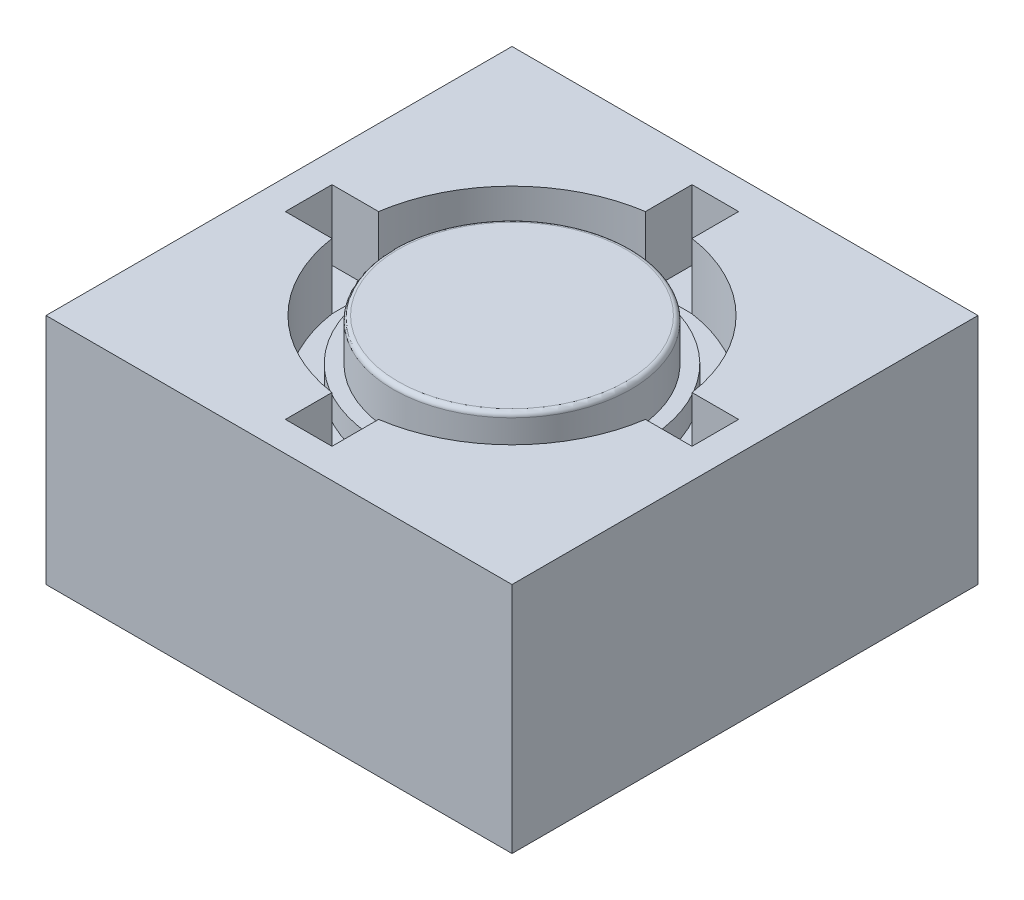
ISO-10303-21;
HEADER;
FILE_DESCRIPTION(('STEP AP214'),'2;1');
FILE_NAME('part.step','',(''),(''),'','','');
FILE_SCHEMA(('AUTOMOTIVE_DESIGN { 1 0 10303 214 1 1 1 1 }'));
ENDSEC;
DATA;
#1=APPLICATION_CONTEXT('core data for automotive mechanical design processes');
#2=APPLICATION_PROTOCOL_DEFINITION('international standard','automotive_design',2000,#1);
#3=PRODUCT_CONTEXT('',#1,'mechanical');
#4=PRODUCT('Part','Part','',(#3));
#5=PRODUCT_RELATED_PRODUCT_CATEGORY('part','',(#4));
#6=PRODUCT_DEFINITION_FORMATION('','',#4);
#7=PRODUCT_DEFINITION_CONTEXT('part definition',#1,'design');
#8=PRODUCT_DEFINITION('design','',#6,#7);
#9=PRODUCT_DEFINITION_SHAPE('','',#8);
#10=(LENGTH_UNIT() NAMED_UNIT(*) SI_UNIT(.MILLI.,.METRE.));
#11=(NAMED_UNIT(*) PLANE_ANGLE_UNIT() SI_UNIT($,.RADIAN.));
#12=(NAMED_UNIT(*) SI_UNIT($,.STERADIAN.) SOLID_ANGLE_UNIT());
#13=UNCERTAINTY_MEASURE_WITH_UNIT(LENGTH_MEASURE(1.E-05),#10,'distance_accuracy_value','');
#14=(GEOMETRIC_REPRESENTATION_CONTEXT(3) GLOBAL_UNCERTAINTY_ASSIGNED_CONTEXT((#13)) GLOBAL_UNIT_ASSIGNED_CONTEXT((#10,
#11,#12)) REPRESENTATION_CONTEXT('',''));
#15=CARTESIAN_POINT('',(0.,0.,0.));
#16=DIRECTION('',(0.,0.,1.));
#17=DIRECTION('',(1.,0.,0.));
#18=AXIS2_PLACEMENT_3D('',#15,#16,#17);
#19=CARTESIAN_POINT('',(0.,7.2,0.));
#20=DIRECTION('',(0.,1.,0.));
#21=DIRECTION('',(0.,0.,1.));
#22=AXIS2_PLACEMENT_3D('',#19,#20,#21);
#23=CYLINDRICAL_SURFACE('',#22,6.8);
#24=CARTESIAN_POINT('',(0.,10.,0.));
#25=DIRECTION('',(0.,1.,0.));
#26=DIRECTION('',(0.,0.,1.));
#27=AXIS2_PLACEMENT_3D('',#24,#25,#26);
#28=CIRCLE('',#27,6.8);
#29=CARTESIAN_POINT('',(1.,10.,6.72606868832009));
#30=VERTEX_POINT('',#29);
#31=CARTESIAN_POINT('',(6.72606868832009,10.,1.00000000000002));
#32=VERTEX_POINT('',#31);
#33=EDGE_CURVE('E342',#30,#32,#28,.T.);
#34=ORIENTED_EDGE('',*,*,#33,.T.);
#35=DIRECTION('',(0.,1.,0.));
#36=VECTOR('',#35,1.);
#37=CARTESIAN_POINT('',(6.72606868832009,7.,1.00000000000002));
#38=LINE('',#37,#36);
#39=CARTESIAN_POINT('',(6.72606868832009,7.2,1.00000000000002));
#40=VERTEX_POINT('',#39);
#41=EDGE_CURVE('E205',#40,#32,#38,.T.);
#42=ORIENTED_EDGE('',*,*,#41,.F.);
#43=CARTESIAN_POINT('',(0.,7.2,0.));
#44=DIRECTION('',(0.,1.,0.));
#45=DIRECTION('',(0.,0.,1.));
#46=AXIS2_PLACEMENT_3D('',#43,#44,#45);
#47=CIRCLE('',#46,6.8);
#48=CARTESIAN_POINT('',(1.,7.2,6.72606868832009));
#49=VERTEX_POINT('',#48);
#50=EDGE_CURVE('E336',#49,#40,#47,.T.);
#51=ORIENTED_EDGE('',*,*,#50,.F.);
#52=DIRECTION('',(0.,1.,0.));
#53=VECTOR('',#52,1.);
#54=CARTESIAN_POINT('',(1.,7.,6.72606868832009));
#55=LINE('',#54,#53);
#56=EDGE_CURVE('E308',#49,#30,#55,.T.);
#57=ORIENTED_EDGE('',*,*,#56,.T.);
#58=EDGE_LOOP('',(#34,#42,#51,#57));
#59=FACE_BOUND('',#58,.T.);
#60=ADVANCED_FACE('F39',(#59),#23,.F.);
#61=CARTESIAN_POINT('',(-1.,10.,-6.72606868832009));
#62=VERTEX_POINT('',#61);
#63=CARTESIAN_POINT('',(-6.72606868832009,10.,-1.00000000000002));
#64=VERTEX_POINT('',#63);
#65=EDGE_CURVE('E347',#62,#64,#28,.T.);
#66=ORIENTED_EDGE('',*,*,#65,.T.);
#67=DIRECTION('',(0.,1.,0.));
#68=VECTOR('',#67,1.);
#69=CARTESIAN_POINT('',(-6.72606868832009,7.,-1.00000000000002));
#70=LINE('',#69,#68);
#71=CARTESIAN_POINT('',(-6.72606868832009,7.2,-1.00000000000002));
#72=VERTEX_POINT('',#71);
#73=EDGE_CURVE('E262',#72,#64,#70,.T.);
#74=ORIENTED_EDGE('',*,*,#73,.F.);
#75=CARTESIAN_POINT('',(-1.,7.2,-6.72606868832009));
#76=VERTEX_POINT('',#75);
#77=EDGE_CURVE('E341',#76,#72,#47,.T.);
#78=ORIENTED_EDGE('',*,*,#77,.F.);
#79=DIRECTION('',(0.,1.,0.));
#80=VECTOR('',#79,1.);
#81=CARTESIAN_POINT('',(-1.,7.,-6.72606868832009));
#82=LINE('',#81,#80);
#83=EDGE_CURVE('E281',#76,#62,#82,.T.);
#84=ORIENTED_EDGE('',*,*,#83,.T.);
#85=EDGE_LOOP('',(#66,#74,#78,#84));
#86=FACE_BOUND('',#85,.T.);
#87=ADVANCED_FACE('F404',(#86),#23,.F.);
#88=CARTESIAN_POINT('',(6.7260686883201,7.2,-0.999999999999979));
#89=VERTEX_POINT('',#88);
#90=CARTESIAN_POINT('',(1.,7.2,-6.72606868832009));
#91=VERTEX_POINT('',#90);
#92=EDGE_CURVE('E340',#89,#91,#47,.T.);
#93=ORIENTED_EDGE('',*,*,#92,.F.);
#94=DIRECTION('',(0.,1.,0.));
#95=VECTOR('',#94,1.);
#96=CARTESIAN_POINT('',(6.7260686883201,7.,-0.999999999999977));
#97=LINE('',#96,#95);
#98=CARTESIAN_POINT('',(6.7260686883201,10.,-0.999999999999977));
#99=VERTEX_POINT('',#98);
#100=EDGE_CURVE('E203',#89,#99,#97,.T.);
#101=ORIENTED_EDGE('',*,*,#100,.T.);
#102=CARTESIAN_POINT('',(1.,10.,-6.72606868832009));
#103=VERTEX_POINT('',#102);
#104=EDGE_CURVE('E346',#99,#103,#28,.T.);
#105=ORIENTED_EDGE('',*,*,#104,.T.);
#106=DIRECTION('',(0.,1.,0.));
#107=VECTOR('',#106,1.);
#108=CARTESIAN_POINT('',(1.,7.,-6.72606868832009));
#109=LINE('',#108,#107);
#110=EDGE_CURVE('E298',#91,#103,#109,.T.);
#111=ORIENTED_EDGE('',*,*,#110,.F.);
#112=EDGE_LOOP('',(#93,#101,#105,#111));
#113=FACE_BOUND('',#112,.T.);
#114=ADVANCED_FACE('F433',(#113),#23,.F.);
#115=CARTESIAN_POINT('',(-10.,10.,-10.));
#116=DIRECTION('',(1.,0.,0.));
#117=DIRECTION('',(0.,0.,-1.));
#118=AXIS2_PLACEMENT_3D('',#115,#116,#117);
#119=PLANE('',#118);
#120=DIRECTION('',(0.,0.,1.));
#121=VECTOR('',#120,1.);
#122=CARTESIAN_POINT('',(-10.,0.,-10.));
#123=LINE('',#122,#121);
#124=CARTESIAN_POINT('',(-10.,0.,-10.));
#125=VERTEX_POINT('',#124);
#126=CARTESIAN_POINT('',(-10.,0.,10.));
#127=VERTEX_POINT('',#126);
#128=EDGE_CURVE('E339',#125,#127,#123,.T.);
#129=ORIENTED_EDGE('',*,*,#128,.T.);
#130=DIRECTION('',(0.,-1.,0.));
#131=VECTOR('',#130,1.);
#132=CARTESIAN_POINT('',(-10.,10.,10.));
#133=LINE('',#132,#131);
#134=CARTESIAN_POINT('',(-10.,10.,10.));
#135=VERTEX_POINT('',#134);
#136=EDGE_CURVE('E374',#135,#127,#133,.T.);
#137=ORIENTED_EDGE('',*,*,#136,.F.);
#138=DIRECTION('',(0.,0.,1.));
#139=VECTOR('',#138,1.);
#140=CARTESIAN_POINT('',(-10.,10.,-10.));
#141=LINE('',#140,#139);
#142=CARTESIAN_POINT('',(-10.,10.,-10.));
#143=VERTEX_POINT('',#142);
#144=EDGE_CURVE('E348',#143,#135,#141,.T.);
#145=ORIENTED_EDGE('',*,*,#144,.F.);
#146=DIRECTION('',(0.,-1.,0.));
#147=VECTOR('',#146,1.);
#148=CARTESIAN_POINT('',(-10.,10.,-10.));
#149=LINE('',#148,#147);
#150=EDGE_CURVE('E358',#143,#125,#149,.T.);
#151=ORIENTED_EDGE('',*,*,#150,.T.);
#152=EDGE_LOOP('',(#129,#137,#145,#151));
#153=FACE_BOUND('',#152,.T.);
#154=ADVANCED_FACE('F490',(#153),#119,.F.);
#155=CARTESIAN_POINT('',(-10.,10.,10.));
#156=DIRECTION('',(0.,0.,-1.));
#157=DIRECTION('',(-1.,0.,0.));
#158=AXIS2_PLACEMENT_3D('',#155,#156,#157);
#159=PLANE('',#158);
#160=DIRECTION('',(1.,0.,0.));
#161=VECTOR('',#160,1.);
#162=CARTESIAN_POINT('',(-10.,0.,10.));
#163=LINE('',#162,#161);
#164=CARTESIAN_POINT('',(10.,0.,10.));
#165=VERTEX_POINT('',#164);
#166=EDGE_CURVE('E361',#127,#165,#163,.T.);
#167=ORIENTED_EDGE('',*,*,#166,.T.);
#168=DIRECTION('',(0.,-1.,0.));
#169=VECTOR('',#168,1.);
#170=CARTESIAN_POINT('',(10.,10.,10.));
#171=LINE('',#170,#169);
#172=CARTESIAN_POINT('',(10.,10.,10.));
#173=VERTEX_POINT('',#172);
#174=EDGE_CURVE('E371',#173,#165,#171,.T.);
#175=ORIENTED_EDGE('',*,*,#174,.F.);
#176=DIRECTION('',(1.,0.,0.));
#177=VECTOR('',#176,1.);
#178=CARTESIAN_POINT('',(-10.,10.,10.));
#179=LINE('',#178,#177);
#180=EDGE_CURVE('E351',#135,#173,#179,.T.);
#181=ORIENTED_EDGE('',*,*,#180,.F.);
#182=ORIENTED_EDGE('',*,*,#136,.T.);
#183=EDGE_LOOP('',(#167,#175,#181,#182));
#184=FACE_BOUND('',#183,.T.);
#185=ADVANCED_FACE('F494',(#184),#159,.F.);
#186=CARTESIAN_POINT('',(10.,10.,-10.));
#187=DIRECTION('',(-1.,0.,0.));
#188=DIRECTION('',(0.,0.,1.));
#189=AXIS2_PLACEMENT_3D('',#186,#187,#188);
#190=PLANE('',#189);
#191=DIRECTION('',(0.,0.,-1.));
#192=VECTOR('',#191,1.);
#193=CARTESIAN_POINT('',(10.,0.,-10.));
#194=LINE('',#193,#192);
#195=CARTESIAN_POINT('',(10.,0.,-10.));
#196=VERTEX_POINT('',#195);
#197=EDGE_CURVE('E363',#165,#196,#194,.T.);
#198=ORIENTED_EDGE('',*,*,#197,.T.);
#199=DIRECTION('',(0.,-1.,0.));
#200=VECTOR('',#199,1.);
#201=CARTESIAN_POINT('',(10.,10.,-10.));
#202=LINE('',#201,#200);
#203=CARTESIAN_POINT('',(10.,10.,-10.));
#204=VERTEX_POINT('',#203);
#205=EDGE_CURVE('E368',#204,#196,#202,.T.);
#206=ORIENTED_EDGE('',*,*,#205,.F.);
#207=DIRECTION('',(0.,0.,-1.));
#208=VECTOR('',#207,1.);
#209=CARTESIAN_POINT('',(10.,10.,-10.));
#210=LINE('',#209,#208);
#211=EDGE_CURVE('E354',#173,#204,#210,.T.);
#212=ORIENTED_EDGE('',*,*,#211,.F.);
#213=ORIENTED_EDGE('',*,*,#174,.T.);
#214=EDGE_LOOP('',(#198,#206,#212,#213));
#215=FACE_BOUND('',#214,.T.);
#216=ADVANCED_FACE('F499',(#215),#190,.F.);
#217=CARTESIAN_POINT('',(-10.,10.,-10.));
#218=DIRECTION('',(0.,0.,1.));
#219=DIRECTION('',(1.,0.,0.));
#220=AXIS2_PLACEMENT_3D('',#217,#218,#219);
#221=PLANE('',#220);
#222=DIRECTION('',(-1.,0.,0.));
#223=VECTOR('',#222,1.);
#224=CARTESIAN_POINT('',(-10.,0.,-10.));
#225=LINE('',#224,#223);
#226=EDGE_CURVE('E352',#196,#125,#225,.T.);
#227=ORIENTED_EDGE('',*,*,#226,.T.);
#228=ORIENTED_EDGE('',*,*,#150,.F.);
#229=DIRECTION('',(-1.,0.,0.));
#230=VECTOR('',#229,1.);
#231=CARTESIAN_POINT('',(-10.,10.,-10.));
#232=LINE('',#231,#230);
#233=EDGE_CURVE('E356',#204,#143,#232,.T.);
#234=ORIENTED_EDGE('',*,*,#233,.F.);
#235=ORIENTED_EDGE('',*,*,#205,.T.);
#236=EDGE_LOOP('',(#227,#228,#234,#235));
#237=FACE_BOUND('',#236,.T.);
#238=ADVANCED_FACE('F505',(#237),#221,.F.);
#239=CARTESIAN_POINT('',(0.,10.,0.));
#240=DIRECTION('',(0.,1.,0.));
#241=DIRECTION('',(0.,0.,1.));
#242=AXIS2_PLACEMENT_3D('',#239,#240,#241);
#243=PLANE('',#242);
#244=DIRECTION('',(-1.,0.,0.));
#245=VECTOR('',#244,1.);
#246=CARTESIAN_POINT('',(8.7260686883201,10.,-0.99999999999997));
#247=LINE('',#246,#245);
#248=CARTESIAN_POINT('',(8.7260686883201,10.,-0.99999999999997));
#249=VERTEX_POINT('',#248);
#250=EDGE_CURVE('E228',#249,#99,#247,.T.);
#251=ORIENTED_EDGE('',*,*,#250,.F.);
#252=DIRECTION('',(0.,0.,-1.));
#253=VECTOR('',#252,1.);
#254=CARTESIAN_POINT('',(8.7260686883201,10.,-0.99999999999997));
#255=LINE('',#254,#253);
#256=CARTESIAN_POINT('',(8.72606868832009,10.,1.00000000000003));
#257=VERTEX_POINT('',#256);
#258=EDGE_CURVE('E220',#257,#249,#255,.T.);
#259=ORIENTED_EDGE('',*,*,#258,.F.);
#260=DIRECTION('',(1.,0.,0.));
#261=VECTOR('',#260,1.);
#262=CARTESIAN_POINT('',(8.72606868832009,10.,1.00000000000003));
#263=LINE('',#262,#261);
#264=EDGE_CURVE('E223',#32,#257,#263,.T.);
#265=ORIENTED_EDGE('',*,*,#264,.F.);
#266=ORIENTED_EDGE('',*,*,#33,.F.);
#267=DIRECTION('',(0.,0.,-1.));
#268=VECTOR('',#267,1.);
#269=CARTESIAN_POINT('',(1.,10.,6.72606868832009));
#270=LINE('',#269,#268);
#271=CARTESIAN_POINT('',(1.,10.,8.7260686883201));
#272=VERTEX_POINT('',#271);
#273=EDGE_CURVE('E312',#272,#30,#270,.T.);
#274=ORIENTED_EDGE('',*,*,#273,.F.);
#275=DIRECTION('',(1.,0.,0.));
#276=VECTOR('',#275,1.);
#277=CARTESIAN_POINT('',(-0.999999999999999,10.,8.7260686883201));
#278=LINE('',#277,#276);
#279=CARTESIAN_POINT('',(-0.999999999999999,10.,8.7260686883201));
#280=VERTEX_POINT('',#279);
#281=EDGE_CURVE('E314',#280,#272,#278,.T.);
#282=ORIENTED_EDGE('',*,*,#281,.F.);
#283=DIRECTION('',(0.,0.,1.));
#284=VECTOR('',#283,1.);
#285=CARTESIAN_POINT('',(-0.999999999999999,10.,6.72606868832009));
#286=LINE('',#285,#284);
#287=CARTESIAN_POINT('',(-0.999999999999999,10.,6.72606868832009));
#288=VERTEX_POINT('',#287);
#289=EDGE_CURVE('E285',#288,#280,#286,.T.);
#290=ORIENTED_EDGE('',*,*,#289,.F.);
#291=CARTESIAN_POINT('',(-6.7260686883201,10.,0.999999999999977));
#292=VERTEX_POINT('',#291);
#293=EDGE_CURVE('E333',#292,#288,#28,.T.);
#294=ORIENTED_EDGE('',*,*,#293,.F.);
#295=DIRECTION('',(1.,0.,0.));
#296=VECTOR('',#295,1.);
#297=CARTESIAN_POINT('',(-6.7260686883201,10.,0.999999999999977));
#298=LINE('',#297,#296);
#299=CARTESIAN_POINT('',(-8.7260686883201,10.,0.999999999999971));
#300=VERTEX_POINT('',#299);
#301=EDGE_CURVE('E243',#300,#292,#298,.T.);
#302=ORIENTED_EDGE('',*,*,#301,.F.);
#303=DIRECTION('',(0.,0.,1.));
#304=VECTOR('',#303,1.);
#305=CARTESIAN_POINT('',(-8.72606868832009,10.,-1.00000000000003));
#306=LINE('',#305,#304);
#307=CARTESIAN_POINT('',(-8.72606868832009,10.,-1.00000000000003));
#308=VERTEX_POINT('',#307);
#309=EDGE_CURVE('E256',#308,#300,#306,.T.);
#310=ORIENTED_EDGE('',*,*,#309,.F.);
#311=DIRECTION('',(-1.,0.,0.));
#312=VECTOR('',#311,1.);
#313=CARTESIAN_POINT('',(-6.72606868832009,10.,-1.00000000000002));
#314=LINE('',#313,#312);
#315=EDGE_CURVE('E253',#64,#308,#314,.T.);
#316=ORIENTED_EDGE('',*,*,#315,.F.);
#317=ORIENTED_EDGE('',*,*,#65,.F.);
#318=DIRECTION('',(0.,0.,1.));
#319=VECTOR('',#318,1.);
#320=CARTESIAN_POINT('',(-1.,10.,-8.7260686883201));
#321=LINE('',#320,#319);
#322=CARTESIAN_POINT('',(-1.,10.,-8.7260686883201));
#323=VERTEX_POINT('',#322);
#324=EDGE_CURVE('E282',#323,#62,#321,.T.);
#325=ORIENTED_EDGE('',*,*,#324,.F.);
#326=DIRECTION('',(-1.,0.,0.));
#327=VECTOR('',#326,1.);
#328=CARTESIAN_POINT('',(-1.,10.,-8.7260686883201));
#329=LINE('',#328,#327);
#330=CARTESIAN_POINT('',(0.999999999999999,10.,-8.7260686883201));
#331=VERTEX_POINT('',#330);
#332=EDGE_CURVE('E272',#331,#323,#329,.T.);
#333=ORIENTED_EDGE('',*,*,#332,.F.);
#334=DIRECTION('',(0.,0.,-1.));
#335=VECTOR('',#334,1.);
#336=CARTESIAN_POINT('',(0.999999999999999,10.,-8.7260686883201));
#337=LINE('',#336,#335);
#338=EDGE_CURVE('E284',#103,#331,#337,.T.);
#339=ORIENTED_EDGE('',*,*,#338,.F.);
#340=ORIENTED_EDGE('',*,*,#104,.F.);
#341=EDGE_LOOP('',(#251,#259,#265,#266,#274,#282,#290,#294,#302,#310,#316,#317,#325,#333,#339,#340));
#342=FACE_BOUND('',#341,.T.);
#343=ORIENTED_EDGE('',*,*,#144,.T.);
#344=ORIENTED_EDGE('',*,*,#180,.T.);
#345=ORIENTED_EDGE('',*,*,#211,.T.);
#346=ORIENTED_EDGE('',*,*,#233,.T.);
#347=EDGE_LOOP('',(#343,#344,#345,#346));
#348=FACE_BOUND('',#347,.T.);
#349=ADVANCED_FACE('F440',(#342,#348),#243,.T.);
#350=CARTESIAN_POINT('',(0.,0.,0.));
#351=DIRECTION('',(0.,1.,0.));
#352=DIRECTION('',(0.,0.,1.));
#353=AXIS2_PLACEMENT_3D('',#350,#351,#352);
#354=PLANE('',#353);
#355=ORIENTED_EDGE('',*,*,#128,.F.);
#356=ORIENTED_EDGE('',*,*,#226,.F.);
#357=ORIENTED_EDGE('',*,*,#197,.F.);
#358=ORIENTED_EDGE('',*,*,#166,.F.);
#359=EDGE_LOOP('',(#355,#356,#357,#358));
#360=FACE_BOUND('',#359,.T.);
#361=ADVANCED_FACE('F481',(#360),#354,.F.);
#362=CARTESIAN_POINT('',(-6.7260686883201,7.2,0.999999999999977));
#363=VERTEX_POINT('',#362);
#364=CARTESIAN_POINT('',(-0.999999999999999,7.2,6.72606868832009));
#365=VERTEX_POINT('',#364);
#366=EDGE_CURVE('E345',#363,#365,#47,.T.);
#367=ORIENTED_EDGE('',*,*,#366,.F.);
#368=DIRECTION('',(0.,1.,0.));
#369=VECTOR('',#368,1.);
#370=CARTESIAN_POINT('',(-6.7260686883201,7.,0.999999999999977));
#371=LINE('',#370,#369);
#372=EDGE_CURVE('E264',#363,#292,#371,.T.);
#373=ORIENTED_EDGE('',*,*,#372,.T.);
#374=ORIENTED_EDGE('',*,*,#293,.T.);
#375=DIRECTION('',(0.,1.,0.));
#376=VECTOR('',#375,1.);
#377=CARTESIAN_POINT('',(-0.999999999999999,7.,6.72606868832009));
#378=LINE('',#377,#376);
#379=EDGE_CURVE('E235',#365,#288,#378,.T.);
#380=ORIENTED_EDGE('',*,*,#379,.F.);
#381=EDGE_LOOP('',(#367,#373,#374,#380));
#382=FACE_BOUND('',#381,.T.);
#383=ADVANCED_FACE('F424',(#382),#23,.F.);
#384=CARTESIAN_POINT('',(0.,7.2,0.));
#385=DIRECTION('',(0.,1.,0.));
#386=DIRECTION('',(0.,0.,1.));
#387=AXIS2_PLACEMENT_3D('',#384,#385,#386);
#388=PLANE('',#387);
#389=DIRECTION('',(0.,0.,1.));
#390=VECTOR('',#389,1.);
#391=CARTESIAN_POINT('',(6.72606868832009,7.2,0.));
#392=LINE('',#391,#390);
#393=EDGE_CURVE('E11',#89,#40,#392,.T.);
#394=ORIENTED_EDGE('',*,*,#393,.F.);
#395=ORIENTED_EDGE('',*,*,#92,.T.);
#396=DIRECTION('',(1.,0.,0.));
#397=VECTOR('',#396,1.);
#398=CARTESIAN_POINT('',(0.,7.2,-6.72606868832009));
#399=LINE('',#398,#397);
#400=EDGE_CURVE('E389',#76,#91,#399,.T.);
#401=ORIENTED_EDGE('',*,*,#400,.F.);
#402=ORIENTED_EDGE('',*,*,#77,.T.);
#403=DIRECTION('',(0.,0.,-1.));
#404=VECTOR('',#403,1.);
#405=CARTESIAN_POINT('',(-6.72606868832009,7.2,0.));
#406=LINE('',#405,#404);
#407=EDGE_CURVE('E47',#363,#72,#406,.T.);
#408=ORIENTED_EDGE('',*,*,#407,.F.);
#409=ORIENTED_EDGE('',*,*,#366,.T.);
#410=DIRECTION('',(-1.,0.,0.));
#411=VECTOR('',#410,1.);
#412=CARTESIAN_POINT('',(0.,7.2,6.72606868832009));
#413=LINE('',#412,#411);
#414=EDGE_CURVE('E386',#49,#365,#413,.T.);
#415=ORIENTED_EDGE('',*,*,#414,.F.);
#416=ORIENTED_EDGE('',*,*,#50,.T.);
#417=EDGE_LOOP('',(#394,#395,#401,#402,#408,#409,#415,#416));
#418=FACE_BOUND('',#417,.T.);
#419=CARTESIAN_POINT('',(0.,7.2,0.));
#420=DIRECTION('',(0.,1.,0.));
#421=DIRECTION('',(0.,0.,1.));
#422=AXIS2_PLACEMENT_3D('',#419,#420,#421);
#423=CIRCLE('',#422,5.7);
#424=CARTESIAN_POINT('',(0.,7.2,5.7));
#425=VERTEX_POINT('',#424);
#426=EDGE_CURVE('E292',#425,#425,#423,.T.);
#427=ORIENTED_EDGE('',*,*,#426,.F.);
#428=EDGE_LOOP('',(#427));
#429=FACE_BOUND('',#428,.T.);
#430=ADVANCED_FACE('F408',(#418,#429),#388,.T.);
#431=CARTESIAN_POINT('',(0.,8.2,0.));
#432=DIRECTION('',(0.,-1.,0.));
#433=DIRECTION('',(0.,0.,-1.));
#434=AXIS2_PLACEMENT_3D('',#431,#432,#433);
#435=CYLINDRICAL_SURFACE('',#434,5.7);
#436=CARTESIAN_POINT('',(0.,8.2,0.));
#437=DIRECTION('',(0.,1.,0.));
#438=DIRECTION('',(0.,0.,1.));
#439=AXIS2_PLACEMENT_3D('',#436,#437,#438);
#440=CIRCLE('',#439,5.7);
#441=CARTESIAN_POINT('',(0.,8.2,5.7));
#442=VERTEX_POINT('',#441);
#443=EDGE_CURVE('E330',#442,#442,#440,.T.);
#444=ORIENTED_EDGE('',*,*,#443,.F.);
#445=EDGE_LOOP('',(#444));
#446=FACE_BOUND('',#445,.T.);
#447=ORIENTED_EDGE('',*,*,#426,.T.);
#448=EDGE_LOOP('',(#447));
#449=FACE_BOUND('',#448,.T.);
#450=ADVANCED_FACE('F486',(#446,#449),#435,.T.);
#451=CARTESIAN_POINT('',(0.,8.2,0.));
#452=DIRECTION('',(0.,1.,0.));
#453=DIRECTION('',(0.,0.,1.));
#454=AXIS2_PLACEMENT_3D('',#451,#452,#453);
#455=PLANE('',#454);
#456=CARTESIAN_POINT('',(0.,8.2,0.));
#457=DIRECTION('',(0.,1.,0.));
#458=DIRECTION('',(0.,0.,1.));
#459=AXIS2_PLACEMENT_3D('',#456,#457,#458);
#460=CIRCLE('',#459,5.1);
#461=CARTESIAN_POINT('',(0.,8.2,5.1));
#462=VERTEX_POINT('',#461);
#463=EDGE_CURVE('E383',#462,#462,#460,.F.);
#464=ORIENTED_EDGE('',*,*,#463,.T.);
#465=EDGE_LOOP('',(#464));
#466=FACE_BOUND('',#465,.T.);
#467=ORIENTED_EDGE('',*,*,#443,.T.);
#468=EDGE_LOOP('',(#467));
#469=FACE_BOUND('',#468,.T.);
#470=ADVANCED_FACE('F514',(#466,#469),#455,.T.);
#471=CARTESIAN_POINT('',(0.,10.,0.));
#472=DIRECTION('',(0.,1.,0.));
#473=DIRECTION('',(0.,0.,1.));
#474=AXIS2_PLACEMENT_3D('',#471,#472,#473);
#475=CIRCLE('',#474,4.9);
#476=CARTESIAN_POINT('',(0.,10.,4.9));
#477=VERTEX_POINT('',#476);
#478=EDGE_CURVE('E377',#477,#477,#475,.T.);
#479=ORIENTED_EDGE('',*,*,#478,.T.);
#480=EDGE_LOOP('',(#479));
#481=FACE_BOUND('',#480,.T.);
#482=ADVANCED_FACE('F510',(#481),#243,.T.);
#483=CARTESIAN_POINT('',(0.,9.8,0.));
#484=DIRECTION('',(0.,1.,0.));
#485=DIRECTION('',(0.,0.,1.));
#486=AXIS2_PLACEMENT_3D('',#483,#484,#485);
#487=TOROIDAL_SURFACE('',#486,4.9,0.2);
#488=CARTESIAN_POINT('',(0.,9.8,0.));
#489=DIRECTION('',(0.,1.,0.));
#490=DIRECTION('',(0.,0.,1.));
#491=AXIS2_PLACEMENT_3D('',#488,#489,#490);
#492=CIRCLE('',#491,5.1);
#493=CARTESIAN_POINT('',(0.,9.8,5.1));
#494=VERTEX_POINT('',#493);
#495=EDGE_CURVE('E380',#494,#494,#492,.F.);
#496=ORIENTED_EDGE('',*,*,#495,.F.);
#497=EDGE_LOOP('',(#496));
#498=FACE_BOUND('',#497,.T.);
#499=ORIENTED_EDGE('',*,*,#478,.F.);
#500=EDGE_LOOP('',(#499));
#501=FACE_BOUND('',#500,.T.);
#502=ADVANCED_FACE('F41',(#498,#501),#487,.T.);
#503=CARTESIAN_POINT('',(0.,7.2,0.));
#504=DIRECTION('',(0.,1.,0.));
#505=DIRECTION('',(0.,0.,1.));
#506=AXIS2_PLACEMENT_3D('',#503,#504,#505);
#507=CYLINDRICAL_SURFACE('',#506,5.1);
#508=ORIENTED_EDGE('',*,*,#463,.F.);
#509=EDGE_LOOP('',(#508));
#510=FACE_BOUND('',#509,.T.);
#511=ORIENTED_EDGE('',*,*,#495,.T.);
#512=EDGE_LOOP('',(#511));
#513=FACE_BOUND('',#512,.T.);
#514=ADVANCED_FACE('F520',(#510,#513),#507,.T.);
#515=CARTESIAN_POINT('',(-0.999999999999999,7.,6.72606868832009));
#516=DIRECTION('',(-1.,0.,0.));
#517=DIRECTION('',(0.,0.,1.));
#518=AXIS2_PLACEMENT_3D('',#515,#516,#517);
#519=PLANE('',#518);
#520=ORIENTED_EDGE('',*,*,#289,.T.);
#521=DIRECTION('',(0.,1.,0.));
#522=VECTOR('',#521,1.);
#523=CARTESIAN_POINT('',(-0.999999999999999,7.,8.7260686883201));
#524=LINE('',#523,#522);
#525=CARTESIAN_POINT('',(-0.999999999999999,7.,8.7260686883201));
#526=VERTEX_POINT('',#525);
#527=EDGE_CURVE('E301',#526,#280,#524,.T.);
#528=ORIENTED_EDGE('',*,*,#527,.F.);
#529=DIRECTION('',(0.,0.,1.));
#530=VECTOR('',#529,1.);
#531=CARTESIAN_POINT('',(-0.999999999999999,7.,6.72606868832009));
#532=LINE('',#531,#530);
#533=CARTESIAN_POINT('',(-0.999999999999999,7.,6.72606868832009));
#534=VERTEX_POINT('',#533);
#535=EDGE_CURVE('E315',#534,#526,#532,.T.);
#536=ORIENTED_EDGE('',*,*,#535,.F.);
#537=EDGE_CURVE('E309',#534,#365,#378,.T.);
#538=ORIENTED_EDGE('',*,*,#537,.T.);
#539=ORIENTED_EDGE('',*,*,#379,.T.);
#540=EDGE_LOOP('',(#520,#528,#536,#538,#539));
#541=FACE_BOUND('',#540,.T.);
#542=ADVANCED_FACE('F422',(#541),#519,.F.);
#543=CARTESIAN_POINT('',(-0.999999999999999,7.,6.72606868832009));
#544=DIRECTION('',(0.,0.,-1.));
#545=DIRECTION('',(-1.,0.,0.));
#546=AXIS2_PLACEMENT_3D('',#543,#544,#545);
#547=PLANE('',#546);
#548=ORIENTED_EDGE('',*,*,#414,.T.);
#549=ORIENTED_EDGE('',*,*,#537,.F.);
#550=DIRECTION('',(-1.,0.,0.));
#551=VECTOR('',#550,1.);
#552=CARTESIAN_POINT('',(-0.999999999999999,7.,6.72606868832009));
#553=LINE('',#552,#551);
#554=CARTESIAN_POINT('',(1.,7.,6.72606868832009));
#555=VERTEX_POINT('',#554);
#556=EDGE_CURVE('E303',#555,#534,#553,.T.);
#557=ORIENTED_EDGE('',*,*,#556,.F.);
#558=EDGE_CURVE('E306',#555,#49,#55,.T.);
#559=ORIENTED_EDGE('',*,*,#558,.T.);
#560=EDGE_LOOP('',(#548,#549,#557,#559));
#561=FACE_BOUND('',#560,.T.);
#562=ADVANCED_FACE('F416',(#561),#547,.F.);
#563=CARTESIAN_POINT('',(1.,7.,6.72606868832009));
#564=DIRECTION('',(1.,0.,0.));
#565=DIRECTION('',(0.,0.,-1.));
#566=AXIS2_PLACEMENT_3D('',#563,#564,#565);
#567=PLANE('',#566);
#568=ORIENTED_EDGE('',*,*,#273,.T.);
#569=ORIENTED_EDGE('',*,*,#56,.F.);
#570=ORIENTED_EDGE('',*,*,#558,.F.);
#571=DIRECTION('',(0.,0.,-1.));
#572=VECTOR('',#571,1.);
#573=CARTESIAN_POINT('',(1.,7.,6.72606868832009));
#574=LINE('',#573,#572);
#575=CARTESIAN_POINT('',(1.,7.,8.7260686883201));
#576=VERTEX_POINT('',#575);
#577=EDGE_CURVE('E322',#576,#555,#574,.T.);
#578=ORIENTED_EDGE('',*,*,#577,.F.);
#579=DIRECTION('',(0.,1.,0.));
#580=VECTOR('',#579,1.);
#581=CARTESIAN_POINT('',(1.,7.,8.7260686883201));
#582=LINE('',#581,#580);
#583=EDGE_CURVE('E304',#576,#272,#582,.T.);
#584=ORIENTED_EDGE('',*,*,#583,.T.);
#585=EDGE_LOOP('',(#568,#569,#570,#578,#584));
#586=FACE_BOUND('',#585,.T.);
#587=ADVANCED_FACE('F548',(#586),#567,.F.);
#588=CARTESIAN_POINT('',(-0.999999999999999,7.,8.7260686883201));
#589=DIRECTION('',(0.,0.,1.));
#590=DIRECTION('',(1.,0.,0.));
#591=AXIS2_PLACEMENT_3D('',#588,#589,#590);
#592=PLANE('',#591);
#593=ORIENTED_EDGE('',*,*,#281,.T.);
#594=ORIENTED_EDGE('',*,*,#583,.F.);
#595=DIRECTION('',(1.,0.,0.));
#596=VECTOR('',#595,1.);
#597=CARTESIAN_POINT('',(-0.999999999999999,7.,8.7260686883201));
#598=LINE('',#597,#596);
#599=EDGE_CURVE('E325',#526,#576,#598,.T.);
#600=ORIENTED_EDGE('',*,*,#599,.F.);
#601=ORIENTED_EDGE('',*,*,#527,.T.);
#602=EDGE_LOOP('',(#593,#594,#600,#601));
#603=FACE_BOUND('',#602,.T.);
#604=ADVANCED_FACE('F552',(#603),#592,.F.);
#605=CARTESIAN_POINT('',(0.,7.,0.));
#606=DIRECTION('',(0.,1.,0.));
#607=DIRECTION('',(0.,0.,1.));
#608=AXIS2_PLACEMENT_3D('',#605,#606,#607);
#609=PLANE('',#608);
#610=ORIENTED_EDGE('',*,*,#535,.T.);
#611=ORIENTED_EDGE('',*,*,#599,.T.);
#612=ORIENTED_EDGE('',*,*,#577,.T.);
#613=ORIENTED_EDGE('',*,*,#556,.T.);
#614=EDGE_LOOP('',(#610,#611,#612,#613));
#615=FACE_BOUND('',#614,.T.);
#616=ADVANCED_FACE('F533',(#615),#609,.T.);
#617=CARTESIAN_POINT('',(-1.,7.,-8.7260686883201));
#618=DIRECTION('',(-1.,0.,0.));
#619=DIRECTION('',(0.,0.,1.));
#620=AXIS2_PLACEMENT_3D('',#617,#618,#619);
#621=PLANE('',#620);
#622=ORIENTED_EDGE('',*,*,#324,.T.);
#623=ORIENTED_EDGE('',*,*,#83,.F.);
#624=CARTESIAN_POINT('',(-1.,7.,-6.72606868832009));
#625=VERTEX_POINT('',#624);
#626=EDGE_CURVE('E299',#625,#76,#82,.T.);
#627=ORIENTED_EDGE('',*,*,#626,.F.);
#628=DIRECTION('',(0.,0.,1.));
#629=VECTOR('',#628,1.);
#630=CARTESIAN_POINT('',(-1.,7.,-8.7260686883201));
#631=LINE('',#630,#629);
#632=CARTESIAN_POINT('',(-1.,7.,-8.7260686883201));
#633=VERTEX_POINT('',#632);
#634=EDGE_CURVE('E268',#633,#625,#631,.T.);
#635=ORIENTED_EDGE('',*,*,#634,.F.);
#636=DIRECTION('',(0.,1.,0.));
#637=VECTOR('',#636,1.);
#638=CARTESIAN_POINT('',(-1.,7.,-8.7260686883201));
#639=LINE('',#638,#637);
#640=EDGE_CURVE('E290',#633,#323,#639,.T.);
#641=ORIENTED_EDGE('',*,*,#640,.T.);
#642=EDGE_LOOP('',(#622,#623,#627,#635,#641));
#643=FACE_BOUND('',#642,.T.);
#644=ADVANCED_FACE('F454',(#643),#621,.F.);
#645=CARTESIAN_POINT('',(-1.,7.,-8.7260686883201));
#646=DIRECTION('',(0.,0.,-1.));
#647=DIRECTION('',(-1.,0.,0.));
#648=AXIS2_PLACEMENT_3D('',#645,#646,#647);
#649=PLANE('',#648);
#650=ORIENTED_EDGE('',*,*,#332,.T.);
#651=ORIENTED_EDGE('',*,*,#640,.F.);
#652=DIRECTION('',(-1.,0.,0.));
#653=VECTOR('',#652,1.);
#654=CARTESIAN_POINT('',(-1.,7.,-8.7260686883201));
#655=LINE('',#654,#653);
#656=CARTESIAN_POINT('',(0.999999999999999,7.,-8.7260686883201));
#657=VERTEX_POINT('',#656);
#658=EDGE_CURVE('E278',#657,#633,#655,.T.);
#659=ORIENTED_EDGE('',*,*,#658,.F.);
#660=DIRECTION('',(0.,1.,0.));
#661=VECTOR('',#660,1.);
#662=CARTESIAN_POINT('',(0.999999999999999,7.,-8.7260686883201));
#663=LINE('',#662,#661);
#664=EDGE_CURVE('E293',#657,#331,#663,.T.);
#665=ORIENTED_EDGE('',*,*,#664,.T.);
#666=EDGE_LOOP('',(#650,#651,#659,#665));
#667=FACE_BOUND('',#666,.T.);
#668=ADVANCED_FACE('F444',(#667),#649,.F.);
#669=CARTESIAN_POINT('',(0.999999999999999,7.,-8.7260686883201));
#670=DIRECTION('',(1.,0.,0.));
#671=DIRECTION('',(0.,0.,-1.));
#672=AXIS2_PLACEMENT_3D('',#669,#670,#671);
#673=PLANE('',#672);
#674=ORIENTED_EDGE('',*,*,#338,.T.);
#675=ORIENTED_EDGE('',*,*,#664,.F.);
#676=DIRECTION('',(0.,0.,-1.));
#677=VECTOR('',#676,1.);
#678=CARTESIAN_POINT('',(0.999999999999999,7.,-8.7260686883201));
#679=LINE('',#678,#677);
#680=CARTESIAN_POINT('',(1.,7.,-6.72606868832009));
#681=VERTEX_POINT('',#680);
#682=EDGE_CURVE('E275',#681,#657,#679,.T.);
#683=ORIENTED_EDGE('',*,*,#682,.F.);
#684=EDGE_CURVE('E295',#681,#91,#109,.T.);
#685=ORIENTED_EDGE('',*,*,#684,.T.);
#686=ORIENTED_EDGE('',*,*,#110,.T.);
#687=EDGE_LOOP('',(#674,#675,#683,#685,#686));
#688=FACE_BOUND('',#687,.T.);
#689=ADVANCED_FACE('F437',(#688),#673,.F.);
#690=CARTESIAN_POINT('',(-1.,7.,-6.72606868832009));
#691=DIRECTION('',(0.,0.,1.));
#692=DIRECTION('',(1.,0.,0.));
#693=AXIS2_PLACEMENT_3D('',#690,#691,#692);
#694=PLANE('',#693);
#695=ORIENTED_EDGE('',*,*,#400,.T.);
#696=ORIENTED_EDGE('',*,*,#684,.F.);
#697=DIRECTION('',(1.,0.,0.));
#698=VECTOR('',#697,1.);
#699=CARTESIAN_POINT('',(-1.,7.,-6.72606868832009));
#700=LINE('',#699,#698);
#701=EDGE_CURVE('E271',#625,#681,#700,.T.);
#702=ORIENTED_EDGE('',*,*,#701,.F.);
#703=ORIENTED_EDGE('',*,*,#626,.T.);
#704=EDGE_LOOP('',(#695,#696,#702,#703));
#705=FACE_BOUND('',#704,.T.);
#706=ADVANCED_FACE('F451',(#705),#694,.F.);
#707=CARTESIAN_POINT('',(0.,7.,0.));
#708=DIRECTION('',(0.,1.,0.));
#709=DIRECTION('',(0.,0.,1.));
#710=AXIS2_PLACEMENT_3D('',#707,#708,#709);
#711=PLANE('',#710);
#712=ORIENTED_EDGE('',*,*,#634,.T.);
#713=ORIENTED_EDGE('',*,*,#701,.T.);
#714=ORIENTED_EDGE('',*,*,#682,.T.);
#715=ORIENTED_EDGE('',*,*,#658,.T.);
#716=EDGE_LOOP('',(#712,#713,#714,#715));
#717=FACE_BOUND('',#716,.T.);
#718=ADVANCED_FACE('F448',(#717),#711,.T.);
#719=CARTESIAN_POINT('',(-6.72606868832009,7.,-1.00000000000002));
#720=DIRECTION('',(0.,0.,-1.));
#721=DIRECTION('',(-1.,0.,0.));
#722=AXIS2_PLACEMENT_3D('',#719,#720,#721);
#723=PLANE('',#722);
#724=ORIENTED_EDGE('',*,*,#315,.T.);
#725=DIRECTION('',(0.,1.,0.));
#726=VECTOR('',#725,1.);
#727=CARTESIAN_POINT('',(-8.72606868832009,7.,-1.00000000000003));
#728=LINE('',#727,#726);
#729=CARTESIAN_POINT('',(-8.72606868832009,7.,-1.00000000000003));
#730=VERTEX_POINT('',#729);
#731=EDGE_CURVE('E252',#730,#308,#728,.T.);
#732=ORIENTED_EDGE('',*,*,#731,.F.);
#733=DIRECTION('',(-1.,0.,0.));
#734=VECTOR('',#733,1.);
#735=CARTESIAN_POINT('',(-6.72606868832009,7.,-1.00000000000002));
#736=LINE('',#735,#734);
#737=CARTESIAN_POINT('',(-6.72606868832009,7.,-1.00000000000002));
#738=VERTEX_POINT('',#737);
#739=EDGE_CURVE('E239',#738,#730,#736,.T.);
#740=ORIENTED_EDGE('',*,*,#739,.F.);
#741=EDGE_CURVE('E230',#738,#72,#70,.T.);
#742=ORIENTED_EDGE('',*,*,#741,.T.);
#743=ORIENTED_EDGE('',*,*,#73,.T.);
#744=EDGE_LOOP('',(#724,#732,#740,#742,#743));
#745=FACE_BOUND('',#744,.T.);
#746=ADVANCED_FACE('F399',(#745),#723,.F.);
#747=CARTESIAN_POINT('',(-6.72606868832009,7.,-1.00000000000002));
#748=DIRECTION('',(1.,0.,0.));
#749=DIRECTION('',(0.,0.,-1.));
#750=AXIS2_PLACEMENT_3D('',#747,#748,#749);
#751=PLANE('',#750);
#752=ORIENTED_EDGE('',*,*,#407,.T.);
#753=ORIENTED_EDGE('',*,*,#741,.F.);
#754=DIRECTION('',(0.,0.,-1.));
#755=VECTOR('',#754,1.);
#756=CARTESIAN_POINT('',(-6.72606868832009,7.,-1.00000000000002));
#757=LINE('',#756,#755);
#758=CARTESIAN_POINT('',(-6.7260686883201,7.,0.999999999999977));
#759=VERTEX_POINT('',#758);
#760=EDGE_CURVE('E249',#759,#738,#757,.T.);
#761=ORIENTED_EDGE('',*,*,#760,.F.);
#762=EDGE_CURVE('E61',#759,#363,#371,.T.);
#763=ORIENTED_EDGE('',*,*,#762,.T.);
#764=EDGE_LOOP('',(#752,#753,#761,#763));
#765=FACE_BOUND('',#764,.T.);
#766=ADVANCED_FACE('F392',(#765),#751,.F.);
#767=CARTESIAN_POINT('',(-6.7260686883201,7.,0.999999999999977));
#768=DIRECTION('',(0.,0.,1.));
#769=DIRECTION('',(1.,0.,0.));
#770=AXIS2_PLACEMENT_3D('',#767,#768,#769);
#771=PLANE('',#770);
#772=ORIENTED_EDGE('',*,*,#301,.T.);
#773=ORIENTED_EDGE('',*,*,#372,.F.);
#774=ORIENTED_EDGE('',*,*,#762,.F.);
#775=DIRECTION('',(1.,0.,0.));
#776=VECTOR('',#775,1.);
#777=CARTESIAN_POINT('',(-6.7260686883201,7.,0.999999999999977));
#778=LINE('',#777,#776);
#779=CARTESIAN_POINT('',(-8.7260686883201,7.,0.999999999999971));
#780=VERTEX_POINT('',#779);
#781=EDGE_CURVE('E246',#780,#759,#778,.T.);
#782=ORIENTED_EDGE('',*,*,#781,.F.);
#783=DIRECTION('',(0.,1.,0.));
#784=VECTOR('',#783,1.);
#785=CARTESIAN_POINT('',(-8.7260686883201,7.,0.999999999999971));
#786=LINE('',#785,#784);
#787=EDGE_CURVE('E265',#780,#300,#786,.T.);
#788=ORIENTED_EDGE('',*,*,#787,.T.);
#789=EDGE_LOOP('',(#772,#773,#774,#782,#788));
#790=FACE_BOUND('',#789,.T.);
#791=ADVANCED_FACE('F463',(#790),#771,.F.);
#792=CARTESIAN_POINT('',(-8.72606868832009,7.,-1.00000000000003));
#793=DIRECTION('',(-1.,0.,0.));
#794=DIRECTION('',(0.,0.,1.));
#795=AXIS2_PLACEMENT_3D('',#792,#793,#794);
#796=PLANE('',#795);
#797=ORIENTED_EDGE('',*,*,#309,.T.);
#798=ORIENTED_EDGE('',*,*,#787,.F.);
#799=DIRECTION('',(0.,0.,1.));
#800=VECTOR('',#799,1.);
#801=CARTESIAN_POINT('',(-8.72606868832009,7.,-1.00000000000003));
#802=LINE('',#801,#800);
#803=EDGE_CURVE('E242',#730,#780,#802,.T.);
#804=ORIENTED_EDGE('',*,*,#803,.F.);
#805=ORIENTED_EDGE('',*,*,#731,.T.);
#806=EDGE_LOOP('',(#797,#798,#804,#805));
#807=FACE_BOUND('',#806,.T.);
#808=ADVANCED_FACE('F458',(#807),#796,.F.);
#809=CARTESIAN_POINT('',(0.,7.,0.));
#810=DIRECTION('',(0.,1.,0.));
#811=DIRECTION('',(-1.,0.,0.));
#812=AXIS2_PLACEMENT_3D('',#809,#810,#811);
#813=PLANE('',#812);
#814=ORIENTED_EDGE('',*,*,#739,.T.);
#815=ORIENTED_EDGE('',*,*,#803,.T.);
#816=ORIENTED_EDGE('',*,*,#781,.T.);
#817=ORIENTED_EDGE('',*,*,#760,.T.);
#818=EDGE_LOOP('',(#814,#815,#816,#817));
#819=FACE_BOUND('',#818,.T.);
#820=ADVANCED_FACE('F461',(#819),#813,.T.);
#821=CARTESIAN_POINT('',(8.7260686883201,7.,-0.99999999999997));
#822=DIRECTION('',(0.,0.,-1.));
#823=DIRECTION('',(-1.,0.,0.));
#824=AXIS2_PLACEMENT_3D('',#821,#822,#823);
#825=PLANE('',#824);
#826=ORIENTED_EDGE('',*,*,#250,.T.);
#827=ORIENTED_EDGE('',*,*,#100,.F.);
#828=CARTESIAN_POINT('',(6.7260686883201,7.,-0.999999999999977));
#829=VERTEX_POINT('',#828);
#830=EDGE_CURVE('E53',#829,#89,#97,.T.);
#831=ORIENTED_EDGE('',*,*,#830,.F.);
#832=DIRECTION('',(-1.,0.,0.));
#833=VECTOR('',#832,1.);
#834=CARTESIAN_POINT('',(8.7260686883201,7.,-0.99999999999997));
#835=LINE('',#834,#833);
#836=CARTESIAN_POINT('',(8.7260686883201,7.,-0.99999999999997));
#837=VERTEX_POINT('',#836);
#838=EDGE_CURVE('E200',#837,#829,#835,.T.);
#839=ORIENTED_EDGE('',*,*,#838,.F.);
#840=DIRECTION('',(0.,1.,0.));
#841=VECTOR('',#840,1.);
#842=CARTESIAN_POINT('',(8.7260686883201,7.,-0.99999999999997));
#843=LINE('',#842,#841);
#844=EDGE_CURVE('E233',#837,#249,#843,.T.);
#845=ORIENTED_EDGE('',*,*,#844,.T.);
#846=EDGE_LOOP('',(#826,#827,#831,#839,#845));
#847=FACE_BOUND('',#846,.T.);
#848=ADVANCED_FACE('F198',(#847),#825,.F.);
#849=CARTESIAN_POINT('',(8.7260686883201,7.,-0.99999999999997));
#850=DIRECTION('',(1.,0.,0.));
#851=DIRECTION('',(0.,0.,-1.));
#852=AXIS2_PLACEMENT_3D('',#849,#850,#851);
#853=PLANE('',#852);
#854=ORIENTED_EDGE('',*,*,#258,.T.);
#855=ORIENTED_EDGE('',*,*,#844,.F.);
#856=DIRECTION('',(0.,0.,-1.));
#857=VECTOR('',#856,1.);
#858=CARTESIAN_POINT('',(8.7260686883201,7.,-0.99999999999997));
#859=LINE('',#858,#857);
#860=CARTESIAN_POINT('',(8.72606868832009,7.,1.00000000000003));
#861=VERTEX_POINT('',#860);
#862=EDGE_CURVE('E219',#861,#837,#859,.T.);
#863=ORIENTED_EDGE('',*,*,#862,.F.);
#864=DIRECTION('',(0.,1.,0.));
#865=VECTOR('',#864,1.);
#866=CARTESIAN_POINT('',(8.72606868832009,7.,1.00000000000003));
#867=LINE('',#866,#865);
#868=EDGE_CURVE('E236',#861,#257,#867,.T.);
#869=ORIENTED_EDGE('',*,*,#868,.T.);
#870=EDGE_LOOP('',(#854,#855,#863,#869));
#871=FACE_BOUND('',#870,.T.);
#872=ADVANCED_FACE('F571',(#871),#853,.F.);
#873=CARTESIAN_POINT('',(8.72606868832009,7.,1.00000000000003));
#874=DIRECTION('',(0.,0.,1.));
#875=DIRECTION('',(1.,0.,0.));
#876=AXIS2_PLACEMENT_3D('',#873,#874,#875);
#877=PLANE('',#876);
#878=ORIENTED_EDGE('',*,*,#264,.T.);
#879=ORIENTED_EDGE('',*,*,#868,.F.);
#880=DIRECTION('',(1.,0.,0.));
#881=VECTOR('',#880,1.);
#882=CARTESIAN_POINT('',(8.72606868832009,7.,1.00000000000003));
#883=LINE('',#882,#881);
#884=CARTESIAN_POINT('',(6.72606868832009,7.,1.00000000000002));
#885=VERTEX_POINT('',#884);
#886=EDGE_CURVE('E215',#885,#861,#883,.T.);
#887=ORIENTED_EDGE('',*,*,#886,.F.);
#888=EDGE_CURVE('E211',#885,#40,#38,.T.);
#889=ORIENTED_EDGE('',*,*,#888,.T.);
#890=ORIENTED_EDGE('',*,*,#41,.T.);
#891=EDGE_LOOP('',(#878,#879,#887,#889,#890));
#892=FACE_BOUND('',#891,.T.);
#893=ADVANCED_FACE('F569',(#892),#877,.F.);
#894=CARTESIAN_POINT('',(6.7260686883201,7.,-0.999999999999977));
#895=DIRECTION('',(-1.,0.,0.));
#896=DIRECTION('',(0.,0.,1.));
#897=AXIS2_PLACEMENT_3D('',#894,#895,#896);
#898=PLANE('',#897);
#899=ORIENTED_EDGE('',*,*,#393,.T.);
#900=ORIENTED_EDGE('',*,*,#888,.F.);
#901=DIRECTION('',(0.,0.,1.));
#902=VECTOR('',#901,1.);
#903=CARTESIAN_POINT('',(6.7260686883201,7.,-0.999999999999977));
#904=LINE('',#903,#902);
#905=EDGE_CURVE('E208',#829,#885,#904,.T.);
#906=ORIENTED_EDGE('',*,*,#905,.F.);
#907=ORIENTED_EDGE('',*,*,#830,.T.);
#908=EDGE_LOOP('',(#899,#900,#906,#907));
#909=FACE_BOUND('',#908,.T.);
#910=ADVANCED_FACE('F209',(#909),#898,.F.);
#911=CARTESIAN_POINT('',(0.,7.,0.));
#912=DIRECTION('',(0.,1.,0.));
#913=DIRECTION('',(-1.,0.,0.));
#914=AXIS2_PLACEMENT_3D('',#911,#912,#913);
#915=PLANE('',#914);
#916=ORIENTED_EDGE('',*,*,#838,.T.);
#917=ORIENTED_EDGE('',*,*,#905,.T.);
#918=ORIENTED_EDGE('',*,*,#886,.T.);
#919=ORIENTED_EDGE('',*,*,#862,.T.);
#920=EDGE_LOOP('',(#916,#917,#918,#919));
#921=FACE_BOUND('',#920,.T.);
#922=ADVANCED_FACE('F217',(#921),#915,.T.);
#923=CLOSED_SHELL('',(#60,#87,#114,#154,#185,#216,#238,#349,#361,#383,#430,#450,#470,#482,#502,
#514,#542,#562,#587,#604,#616,#644,#668,#689,#706,#718,#746,#766,#791,#808,#820,#848,#872,#893,
#910,#922));
#924=MANIFOLD_SOLID_BREP('B2',#923);
#925=ADVANCED_BREP_SHAPE_REPRESENTATION('',(#18,#924),#14);
#926=SHAPE_DEFINITION_REPRESENTATION(#9,#925);
ENDSEC;
END-ISO-10303-21;
